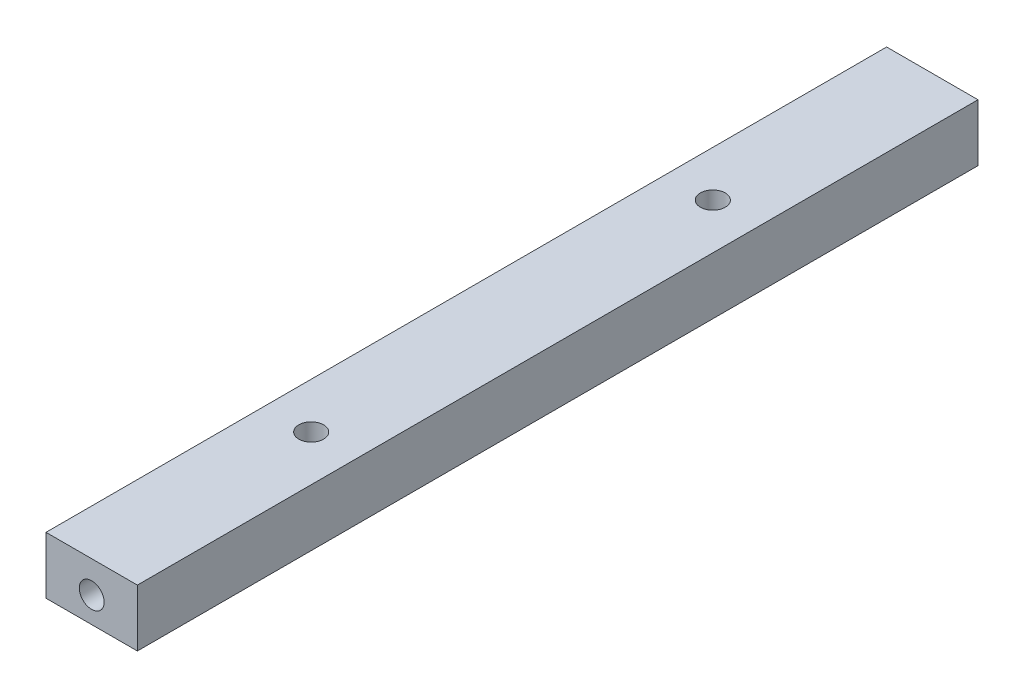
ISO-10303-21;
HEADER;
FILE_DESCRIPTION(('STEP AP214'),'2;1');
FILE_NAME('part.step','',(''),(''),'','','');
FILE_SCHEMA(('AUTOMOTIVE_DESIGN { 1 0 10303 214 1 1 1 1 }'));
ENDSEC;
DATA;
#1=APPLICATION_CONTEXT('core data for automotive mechanical design processes');
#2=APPLICATION_PROTOCOL_DEFINITION('international standard','automotive_design',2000,#1);
#3=PRODUCT_CONTEXT('',#1,'mechanical');
#4=PRODUCT('Part','Part','',(#3));
#5=PRODUCT_RELATED_PRODUCT_CATEGORY('part','',(#4));
#6=PRODUCT_DEFINITION_FORMATION('','',#4);
#7=PRODUCT_DEFINITION_CONTEXT('part definition',#1,'design');
#8=PRODUCT_DEFINITION('design','',#6,#7);
#9=PRODUCT_DEFINITION_SHAPE('','',#8);
#10=(LENGTH_UNIT() NAMED_UNIT(*) SI_UNIT(.MILLI.,.METRE.));
#11=(NAMED_UNIT(*) PLANE_ANGLE_UNIT() SI_UNIT($,.RADIAN.));
#12=(NAMED_UNIT(*) SI_UNIT($,.STERADIAN.) SOLID_ANGLE_UNIT());
#13=UNCERTAINTY_MEASURE_WITH_UNIT(LENGTH_MEASURE(1.E-05),#10,'distance_accuracy_value','');
#14=(GEOMETRIC_REPRESENTATION_CONTEXT(3) GLOBAL_UNCERTAINTY_ASSIGNED_CONTEXT((#13)) GLOBAL_UNIT_ASSIGNED_CONTEXT((#10,
#11,#12)) REPRESENTATION_CONTEXT('',''));
#15=CARTESIAN_POINT('',(0.,0.,0.));
#16=DIRECTION('',(0.,0.,1.));
#17=DIRECTION('',(1.,0.,0.));
#18=AXIS2_PLACEMENT_3D('',#15,#16,#17);
#19=CARTESIAN_POINT('',(0.,0.,116.84));
#20=DIRECTION('',(1.,0.,0.));
#21=DIRECTION('',(0.,0.,-1.));
#22=AXIS2_PLACEMENT_3D('',#19,#20,#21);
#23=PLANE('',#22);
#24=DIRECTION('',(0.,-1.,0.));
#25=VECTOR('',#24,1.);
#26=CARTESIAN_POINT('',(0.,0.,0.));
#27=LINE('',#26,#25);
#28=CARTESIAN_POINT('',(0.,7.9375,0.));
#29=VERTEX_POINT('',#28);
#30=CARTESIAN_POINT('',(0.,0.,0.));
#31=VERTEX_POINT('',#30);
#32=EDGE_CURVE('E72',#29,#31,#27,.T.);
#33=ORIENTED_EDGE('',*,*,#32,.T.);
#34=DIRECTION('',(0.,0.,-1.));
#35=VECTOR('',#34,1.);
#36=CARTESIAN_POINT('',(0.,0.,116.84));
#37=LINE('',#36,#35);
#38=CARTESIAN_POINT('',(0.,0.,116.84));
#39=VERTEX_POINT('',#38);
#40=EDGE_CURVE('E11',#39,#31,#37,.T.);
#41=ORIENTED_EDGE('',*,*,#40,.F.);
#42=DIRECTION('',(0.,-1.,0.));
#43=VECTOR('',#42,1.);
#44=CARTESIAN_POINT('',(0.,0.,116.84));
#45=LINE('',#44,#43);
#46=CARTESIAN_POINT('',(0.,7.9375,116.84));
#47=VERTEX_POINT('',#46);
#48=EDGE_CURVE('E95',#47,#39,#45,.T.);
#49=ORIENTED_EDGE('',*,*,#48,.F.);
#50=DIRECTION('',(0.,0.,-1.));
#51=VECTOR('',#50,1.);
#52=CARTESIAN_POINT('',(0.,7.9375,116.84));
#53=LINE('',#52,#51);
#54=EDGE_CURVE('E84',#47,#29,#53,.T.);
#55=ORIENTED_EDGE('',*,*,#54,.T.);
#56=EDGE_LOOP('',(#33,#41,#49,#55));
#57=FACE_BOUND('',#56,.T.);
#58=ADVANCED_FACE('F28',(#57),#23,.F.);
#59=CARTESIAN_POINT('',(0.,0.,116.84));
#60=DIRECTION('',(0.,1.,0.));
#61=DIRECTION('',(0.,0.,1.));
#62=AXIS2_PLACEMENT_3D('',#59,#60,#61);
#63=PLANE('',#62);
#64=CARTESIAN_POINT('',(6.35,0.,86.3317503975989));
#65=DIRECTION('',(0.,1.,0.));
#66=DIRECTION('',(0.,0.,1.));
#67=AXIS2_PLACEMENT_3D('',#64,#65,#66);
#68=CIRCLE('',#67,1.7272);
#69=CARTESIAN_POINT('',(6.35,0.,88.0589503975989));
#70=VERTEX_POINT('',#69);
#71=EDGE_CURVE('E133',#70,#70,#68,.T.);
#72=ORIENTED_EDGE('',*,*,#71,.T.);
#73=EDGE_LOOP('',(#72));
#74=FACE_BOUND('',#73,.T.);
#75=CARTESIAN_POINT('',(6.35,0.,30.5082496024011));
#76=DIRECTION('',(0.,1.,0.));
#77=DIRECTION('',(0.,0.,1.));
#78=AXIS2_PLACEMENT_3D('',#75,#76,#77);
#79=CIRCLE('',#78,1.7272);
#80=CARTESIAN_POINT('',(6.35,0.,32.2354496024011));
#81=VERTEX_POINT('',#80);
#82=EDGE_CURVE('E136',#81,#81,#79,.T.);
#83=ORIENTED_EDGE('',*,*,#82,.T.);
#84=EDGE_LOOP('',(#83));
#85=FACE_BOUND('',#84,.T.);
#86=DIRECTION('',(1.,0.,0.));
#87=VECTOR('',#86,1.);
#88=CARTESIAN_POINT('',(0.,0.,0.));
#89=LINE('',#88,#87);
#90=CARTESIAN_POINT('',(12.7,0.,0.));
#91=VERTEX_POINT('',#90);
#92=EDGE_CURVE('E68',#31,#91,#89,.T.);
#93=ORIENTED_EDGE('',*,*,#92,.T.);
#94=DIRECTION('',(0.,0.,-1.));
#95=VECTOR('',#94,1.);
#96=CARTESIAN_POINT('',(12.7,0.,116.84));
#97=LINE('',#96,#95);
#98=CARTESIAN_POINT('',(12.7,0.,116.84));
#99=VERTEX_POINT('',#98);
#100=EDGE_CURVE('E35',#99,#91,#97,.T.);
#101=ORIENTED_EDGE('',*,*,#100,.F.);
#102=DIRECTION('',(1.,0.,0.));
#103=VECTOR('',#102,1.);
#104=CARTESIAN_POINT('',(0.,0.,116.84));
#105=LINE('',#104,#103);
#106=EDGE_CURVE('E80',#39,#99,#105,.T.);
#107=ORIENTED_EDGE('',*,*,#106,.F.);
#108=ORIENTED_EDGE('',*,*,#40,.T.);
#109=EDGE_LOOP('',(#93,#101,#107,#108));
#110=FACE_BOUND('',#109,.T.);
#111=ADVANCED_FACE('F79',(#74,#85,#110),#63,.F.);
#112=CARTESIAN_POINT('',(12.7,0.,116.84));
#113=DIRECTION('',(-1.,0.,0.));
#114=DIRECTION('',(0.,0.,1.));
#115=AXIS2_PLACEMENT_3D('',#112,#113,#114);
#116=PLANE('',#115);
#117=DIRECTION('',(0.,1.,0.));
#118=VECTOR('',#117,1.);
#119=CARTESIAN_POINT('',(12.7,0.,0.));
#120=LINE('',#119,#118);
#121=CARTESIAN_POINT('',(12.7,7.9375,0.));
#122=VERTEX_POINT('',#121);
#123=EDGE_CURVE('E73',#91,#122,#120,.T.);
#124=ORIENTED_EDGE('',*,*,#123,.T.);
#125=DIRECTION('',(0.,0.,-1.));
#126=VECTOR('',#125,1.);
#127=CARTESIAN_POINT('',(12.7,7.9375,116.84));
#128=LINE('',#127,#126);
#129=CARTESIAN_POINT('',(12.7,7.9375,116.84));
#130=VERTEX_POINT('',#129);
#131=EDGE_CURVE('E101',#130,#122,#128,.T.);
#132=ORIENTED_EDGE('',*,*,#131,.F.);
#133=DIRECTION('',(0.,1.,0.));
#134=VECTOR('',#133,1.);
#135=CARTESIAN_POINT('',(12.7,0.,116.84));
#136=LINE('',#135,#134);
#137=EDGE_CURVE('E47',#99,#130,#136,.T.);
#138=ORIENTED_EDGE('',*,*,#137,.F.);
#139=ORIENTED_EDGE('',*,*,#100,.T.);
#140=EDGE_LOOP('',(#124,#132,#138,#139));
#141=FACE_BOUND('',#140,.T.);
#142=ADVANCED_FACE('F104',(#141),#116,.F.);
#143=CARTESIAN_POINT('',(0.,7.9375,116.84));
#144=DIRECTION('',(0.,-1.,0.));
#145=DIRECTION('',(0.,0.,-1.));
#146=AXIS2_PLACEMENT_3D('',#143,#144,#145);
#147=PLANE('',#146);
#148=CARTESIAN_POINT('',(6.35,7.9375,86.3317503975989));
#149=DIRECTION('',(0.,1.,0.));
#150=DIRECTION('',(0.,0.,-1.));
#151=AXIS2_PLACEMENT_3D('',#148,#149,#150);
#152=CIRCLE('',#151,1.7272);
#153=CARTESIAN_POINT('',(6.35,7.9375,84.6045503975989));
#154=VERTEX_POINT('',#153);
#155=EDGE_CURVE('E182',#154,#154,#152,.T.);
#156=ORIENTED_EDGE('',*,*,#155,.F.);
#157=EDGE_LOOP('',(#156));
#158=FACE_BOUND('',#157,.T.);
#159=CARTESIAN_POINT('',(6.35,7.9375,30.5082496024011));
#160=DIRECTION('',(0.,1.,0.));
#161=DIRECTION('',(0.,0.,1.));
#162=AXIS2_PLACEMENT_3D('',#159,#160,#161);
#163=CIRCLE('',#162,1.7272);
#164=CARTESIAN_POINT('',(6.35,7.9375,32.2354496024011));
#165=VERTEX_POINT('',#164);
#166=EDGE_CURVE('E139',#165,#165,#163,.T.);
#167=ORIENTED_EDGE('',*,*,#166,.F.);
#168=EDGE_LOOP('',(#167));
#169=FACE_BOUND('',#168,.T.);
#170=DIRECTION('',(-1.,0.,0.));
#171=VECTOR('',#170,1.);
#172=CARTESIAN_POINT('',(0.,7.9375,0.));
#173=LINE('',#172,#171);
#174=EDGE_CURVE('E93',#122,#29,#173,.T.);
#175=ORIENTED_EDGE('',*,*,#174,.T.);
#176=ORIENTED_EDGE('',*,*,#54,.F.);
#177=DIRECTION('',(-1.,0.,0.));
#178=VECTOR('',#177,1.);
#179=CARTESIAN_POINT('',(0.,7.9375,116.84));
#180=LINE('',#179,#178);
#181=EDGE_CURVE('E42',#130,#47,#180,.T.);
#182=ORIENTED_EDGE('',*,*,#181,.F.);
#183=ORIENTED_EDGE('',*,*,#131,.T.);
#184=EDGE_LOOP('',(#175,#176,#182,#183));
#185=FACE_BOUND('',#184,.T.);
#186=ADVANCED_FACE('F106',(#158,#169,#185),#147,.F.);
#187=CARTESIAN_POINT('',(0.,7.9375,116.84));
#188=DIRECTION('',(0.,0.,-1.));
#189=DIRECTION('',(-1.,0.,0.));
#190=AXIS2_PLACEMENT_3D('',#187,#188,#189);
#191=PLANE('',#190);
#192=CARTESIAN_POINT('',(6.35,3.556,116.84));
#193=DIRECTION('',(0.,0.,1.));
#194=DIRECTION('',(1.,0.,0.));
#195=AXIS2_PLACEMENT_3D('',#192,#193,#194);
#196=CIRCLE('',#195,1.7272);
#197=CARTESIAN_POINT('',(8.0772,3.556,116.84));
#198=VERTEX_POINT('',#197);
#199=EDGE_CURVE('E88',#198,#198,#196,.T.);
#200=ORIENTED_EDGE('',*,*,#199,.F.);
#201=EDGE_LOOP('',(#200));
#202=FACE_BOUND('',#201,.T.);
#203=ORIENTED_EDGE('',*,*,#48,.T.);
#204=ORIENTED_EDGE('',*,*,#106,.T.);
#205=ORIENTED_EDGE('',*,*,#137,.T.);
#206=ORIENTED_EDGE('',*,*,#181,.T.);
#207=EDGE_LOOP('',(#203,#204,#205,#206));
#208=FACE_BOUND('',#207,.T.);
#209=ADVANCED_FACE('F107',(#202,#208),#191,.F.);
#210=CARTESIAN_POINT('',(0.,7.9375,0.));
#211=DIRECTION('',(0.,0.,-1.));
#212=DIRECTION('',(-1.,0.,0.));
#213=AXIS2_PLACEMENT_3D('',#210,#211,#212);
#214=PLANE('',#213);
#215=CARTESIAN_POINT('',(6.35,3.556,0.));
#216=DIRECTION('',(0.,0.,-1.));
#217=DIRECTION('',(-1.,0.,0.));
#218=AXIS2_PLACEMENT_3D('',#215,#216,#217);
#219=CIRCLE('',#218,1.7272);
#220=CARTESIAN_POINT('',(4.6228,3.556,0.));
#221=VERTEX_POINT('',#220);
#222=EDGE_CURVE('E138',#221,#221,#219,.T.);
#223=ORIENTED_EDGE('',*,*,#222,.F.);
#224=EDGE_LOOP('',(#223));
#225=FACE_BOUND('',#224,.T.);
#226=ORIENTED_EDGE('',*,*,#32,.F.);
#227=ORIENTED_EDGE('',*,*,#174,.F.);
#228=ORIENTED_EDGE('',*,*,#123,.F.);
#229=ORIENTED_EDGE('',*,*,#92,.F.);
#230=EDGE_LOOP('',(#226,#227,#228,#229));
#231=FACE_BOUND('',#230,.T.);
#232=ADVANCED_FACE('F69',(#225,#231),#214,.T.);
#233=CARTESIAN_POINT('',(6.35,3.556,106.68));
#234=DIRECTION('',(0.,0.,1.));
#235=DIRECTION('',(1.,0.,0.));
#236=AXIS2_PLACEMENT_3D('',#233,#234,#235);
#237=CYLINDRICAL_SURFACE('',#236,1.7272);
#238=CARTESIAN_POINT('',(6.35,3.556,106.68));
#239=DIRECTION('',(0.,0.,1.));
#240=DIRECTION('',(1.,0.,0.));
#241=AXIS2_PLACEMENT_3D('',#238,#239,#240);
#242=CIRCLE('',#241,1.7272);
#243=CARTESIAN_POINT('',(8.0772,3.556,106.68));
#244=VERTEX_POINT('',#243);
#245=EDGE_CURVE('E85',#244,#244,#242,.T.);
#246=ORIENTED_EDGE('',*,*,#245,.F.);
#247=EDGE_LOOP('',(#246));
#248=FACE_BOUND('',#247,.T.);
#249=ORIENTED_EDGE('',*,*,#199,.T.);
#250=EDGE_LOOP('',(#249));
#251=FACE_BOUND('',#250,.T.);
#252=ADVANCED_FACE('F115',(#248,#251),#237,.F.);
#253=CARTESIAN_POINT('',(6.35,3.556,106.68));
#254=DIRECTION('',(0.,0.,1.));
#255=DIRECTION('',(1.,0.,0.));
#256=AXIS2_PLACEMENT_3D('',#253,#254,#255);
#257=PLANE('',#256);
#258=ORIENTED_EDGE('',*,*,#245,.T.);
#259=EDGE_LOOP('',(#258));
#260=FACE_BOUND('',#259,.T.);
#261=ADVANCED_FACE('F152',(#260),#257,.T.);
#262=CARTESIAN_POINT('',(6.35,3.556,10.16));
#263=DIRECTION('',(0.,0.,-1.));
#264=DIRECTION('',(-1.,0.,0.));
#265=AXIS2_PLACEMENT_3D('',#262,#263,#264);
#266=CYLINDRICAL_SURFACE('',#265,1.7272);
#267=CARTESIAN_POINT('',(6.35,3.556,10.16));
#268=DIRECTION('',(0.,0.,-1.));
#269=DIRECTION('',(-1.,0.,0.));
#270=AXIS2_PLACEMENT_3D('',#267,#268,#269);
#271=CIRCLE('',#270,1.7272);
#272=CARTESIAN_POINT('',(4.6228,3.556,10.16));
#273=VERTEX_POINT('',#272);
#274=EDGE_CURVE('E142',#273,#273,#271,.T.);
#275=ORIENTED_EDGE('',*,*,#274,.F.);
#276=EDGE_LOOP('',(#275));
#277=FACE_BOUND('',#276,.T.);
#278=ORIENTED_EDGE('',*,*,#222,.T.);
#279=EDGE_LOOP('',(#278));
#280=FACE_BOUND('',#279,.T.);
#281=ADVANCED_FACE('F158',(#277,#280),#266,.F.);
#282=CARTESIAN_POINT('',(6.35,3.556,10.16));
#283=DIRECTION('',(0.,0.,-1.));
#284=DIRECTION('',(-1.,0.,0.));
#285=AXIS2_PLACEMENT_3D('',#282,#283,#284);
#286=PLANE('',#285);
#287=ORIENTED_EDGE('',*,*,#274,.T.);
#288=EDGE_LOOP('',(#287));
#289=FACE_BOUND('',#288,.T.);
#290=ADVANCED_FACE('F165',(#289),#286,.T.);
#291=CARTESIAN_POINT('',(6.35,-2.2225,30.5082496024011));
#292=DIRECTION('',(0.,1.,0.));
#293=DIRECTION('',(0.,0.,1.));
#294=AXIS2_PLACEMENT_3D('',#291,#292,#293);
#295=CYLINDRICAL_SURFACE('',#294,1.7272);
#296=ORIENTED_EDGE('',*,*,#166,.T.);
#297=EDGE_LOOP('',(#296));
#298=FACE_BOUND('',#297,.T.);
#299=ORIENTED_EDGE('',*,*,#82,.F.);
#300=EDGE_LOOP('',(#299));
#301=FACE_BOUND('',#300,.T.);
#302=ADVANCED_FACE('F169',(#298,#301),#295,.F.);
#303=CARTESIAN_POINT('',(6.35,-2.2225,86.3317503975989));
#304=DIRECTION('',(0.,1.,0.));
#305=DIRECTION('',(0.,0.,1.));
#306=AXIS2_PLACEMENT_3D('',#303,#304,#305);
#307=CYLINDRICAL_SURFACE('',#306,1.7272);
#308=ORIENTED_EDGE('',*,*,#155,.T.);
#309=EDGE_LOOP('',(#308));
#310=FACE_BOUND('',#309,.T.);
#311=ORIENTED_EDGE('',*,*,#71,.F.);
#312=EDGE_LOOP('',(#311));
#313=FACE_BOUND('',#312,.T.);
#314=ADVANCED_FACE('F173',(#310,#313),#307,.F.);
#315=CLOSED_SHELL('',(#58,#111,#142,#186,#209,#232,#252,#261,#281,#290,#302,#314));
#316=MANIFOLD_SOLID_BREP('B2',#315);
#317=ADVANCED_BREP_SHAPE_REPRESENTATION('',(#18,#316),#14);
#318=SHAPE_DEFINITION_REPRESENTATION(#9,#317);
ENDSEC;
END-ISO-10303-21;
